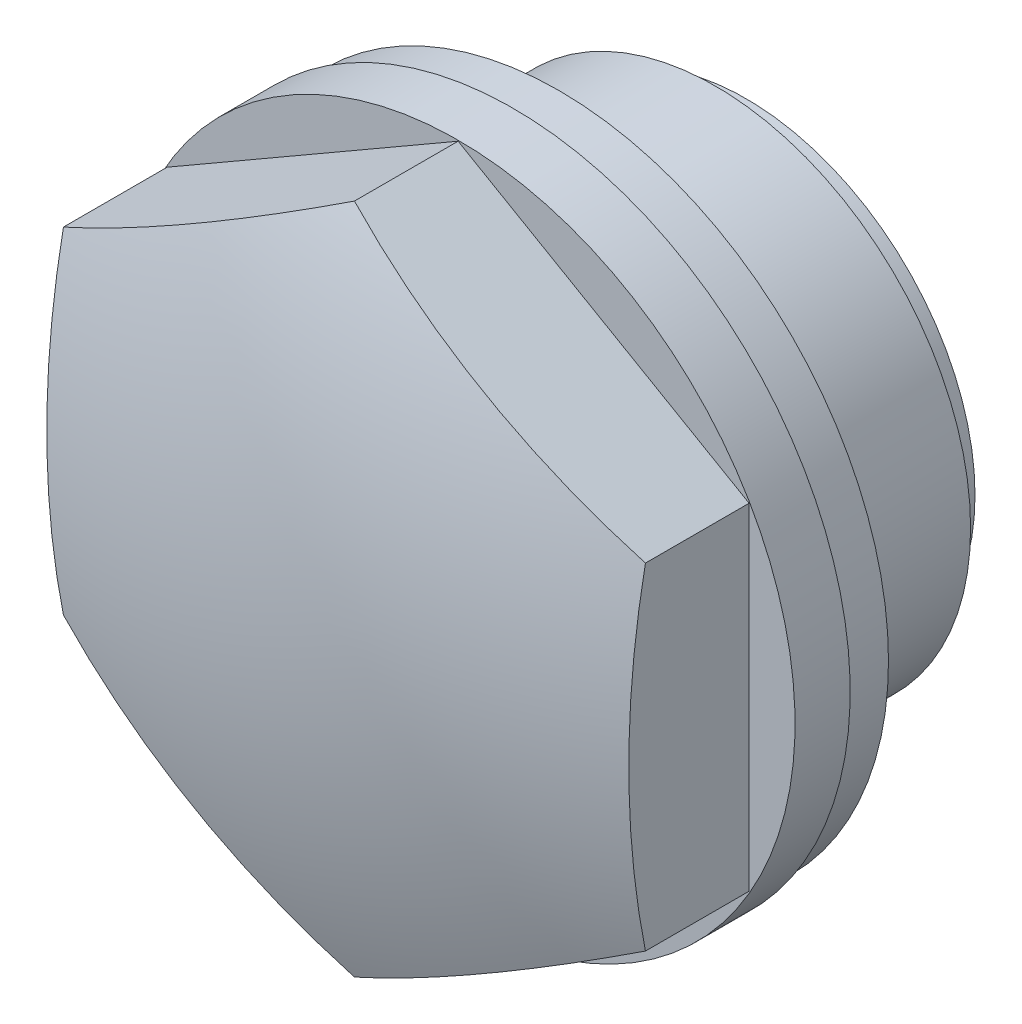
ISO-10303-21;
HEADER;
FILE_DESCRIPTION(('STEP AP214'),'2;1');
FILE_NAME('part.step','',(''),(''),'','','');
FILE_SCHEMA(('AUTOMOTIVE_DESIGN { 1 0 10303 214 1 1 1 1 }'));
ENDSEC;
DATA;
#1=APPLICATION_CONTEXT('core data for automotive mechanical design processes');
#2=APPLICATION_PROTOCOL_DEFINITION('international standard','automotive_design',2000,#1);
#3=PRODUCT_CONTEXT('',#1,'mechanical');
#4=PRODUCT('Part','Part','',(#3));
#5=PRODUCT_RELATED_PRODUCT_CATEGORY('part','',(#4));
#6=PRODUCT_DEFINITION_FORMATION('','',#4);
#7=PRODUCT_DEFINITION_CONTEXT('part definition',#1,'design');
#8=PRODUCT_DEFINITION('design','',#6,#7);
#9=PRODUCT_DEFINITION_SHAPE('','',#8);
#10=(LENGTH_UNIT() NAMED_UNIT(*) SI_UNIT(.MILLI.,.METRE.));
#11=(NAMED_UNIT(*) PLANE_ANGLE_UNIT() SI_UNIT($,.RADIAN.));
#12=(NAMED_UNIT(*) SI_UNIT($,.STERADIAN.) SOLID_ANGLE_UNIT());
#13=UNCERTAINTY_MEASURE_WITH_UNIT(LENGTH_MEASURE(1.E-05),#10,'distance_accuracy_value','');
#14=(GEOMETRIC_REPRESENTATION_CONTEXT(3) GLOBAL_UNCERTAINTY_ASSIGNED_CONTEXT((#13)) GLOBAL_UNIT_ASSIGNED_CONTEXT((#10,
#11,#12)) REPRESENTATION_CONTEXT('',''));
#15=CARTESIAN_POINT('',(0.,0.,0.));
#16=DIRECTION('',(0.,0.,1.));
#17=DIRECTION('',(1.,0.,0.));
#18=AXIS2_PLACEMENT_3D('',#15,#16,#17);
#19=CARTESIAN_POINT('',(0.,0.,-6.0999999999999));
#20=DIRECTION('',(0.,0.,-1.));
#21=DIRECTION('',(-1.,0.,0.));
#22=AXIS2_PLACEMENT_3D('',#19,#20,#21);
#23=PLANE('',#22);
#24=CARTESIAN_POINT('',(0.,0.,-6.0999999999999));
#25=DIRECTION('',(0.,0.,-1.));
#26=DIRECTION('',(-1.,0.,0.));
#27=AXIS2_PLACEMENT_3D('',#24,#25,#26);
#28=CIRCLE('',#27,7.475);
#29=CARTESIAN_POINT('',(-7.475,0.,-6.0999999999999));
#30=VERTEX_POINT('',#29);
#31=EDGE_CURVE('E124',#30,#30,#28,.T.);
#32=ORIENTED_EDGE('',*,*,#31,.T.);
#33=EDGE_LOOP('',(#32));
#34=FACE_BOUND('',#33,.T.);
#35=ADVANCED_FACE('F14',(#34),#23,.T.);
#36=CARTESIAN_POINT('',(0.,0.,-4.3000699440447));
#37=DIRECTION('',(0.,0.,-1.));
#38=DIRECTION('',(-1.,0.,0.));
#39=AXIS2_PLACEMENT_3D('',#36,#37,#38);
#40=CYLINDRICAL_SURFACE('',#39,7.475);
#41=ORIENTED_EDGE('',*,*,#31,.F.);
#42=EDGE_LOOP('',(#41));
#43=FACE_BOUND('',#42,.T.);
#44=CARTESIAN_POINT('',(0.,0.,-5.0999999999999));
#45=DIRECTION('',(0.,0.,-1.));
#46=DIRECTION('',(-1.,0.,0.));
#47=AXIS2_PLACEMENT_3D('',#44,#45,#46);
#48=CIRCLE('',#47,7.475);
#49=CARTESIAN_POINT('',(-7.475,0.,-5.0999999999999));
#50=VERTEX_POINT('',#49);
#51=EDGE_CURVE('E121',#50,#50,#48,.T.);
#52=ORIENTED_EDGE('',*,*,#51,.T.);
#53=EDGE_LOOP('',(#52));
#54=FACE_BOUND('',#53,.T.);
#55=ADVANCED_FACE('F161',(#43,#54),#40,.T.);
#56=CARTESIAN_POINT('',(0.,7.475,-5.0999999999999));
#57=DIRECTION('',(0.,0.,-1.));
#58=DIRECTION('',(-1.,0.,0.));
#59=AXIS2_PLACEMENT_3D('',#56,#57,#58);
#60=PLANE('',#59);
#61=CARTESIAN_POINT('',(0.,0.,-5.0999999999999));
#62=DIRECTION('',(0.,0.,-1.));
#63=DIRECTION('',(-1.,0.,0.));
#64=AXIS2_PLACEMENT_3D('',#61,#62,#63);
#65=CIRCLE('',#64,8.331);
#66=CARTESIAN_POINT('',(-8.331,0.,-5.0999999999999));
#67=VERTEX_POINT('',#66);
#68=EDGE_CURVE('E118',#67,#67,#65,.T.);
#69=ORIENTED_EDGE('',*,*,#68,.T.);
#70=EDGE_LOOP('',(#69));
#71=FACE_BOUND('',#70,.T.);
#72=ORIENTED_EDGE('',*,*,#51,.F.);
#73=EDGE_LOOP('',(#72));
#74=FACE_BOUND('',#73,.T.);
#75=ADVANCED_FACE('F167',(#71,#74),#60,.T.);
#76=CARTESIAN_POINT('',(0.,0.,-4.3000699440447));
#77=DIRECTION('',(0.,0.,-1.));
#78=DIRECTION('',(-1.,0.,0.));
#79=AXIS2_PLACEMENT_3D('',#76,#77,#78);
#80=CYLINDRICAL_SURFACE('',#79,8.331);
#81=ORIENTED_EDGE('',*,*,#68,.F.);
#82=EDGE_LOOP('',(#81));
#83=FACE_BOUND('',#82,.T.);
#84=CARTESIAN_POINT('',(0.,0.,0.));
#85=DIRECTION('',(0.,0.,-1.));
#86=DIRECTION('',(-1.,0.,0.));
#87=AXIS2_PLACEMENT_3D('',#84,#85,#86);
#88=CIRCLE('',#87,8.331);
#89=CARTESIAN_POINT('',(-8.331,0.,0.));
#90=VERTEX_POINT('',#89);
#91=EDGE_CURVE('E115',#90,#90,#88,.T.);
#92=ORIENTED_EDGE('',*,*,#91,.T.);
#93=EDGE_LOOP('',(#92));
#94=FACE_BOUND('',#93,.T.);
#95=ADVANCED_FACE('F174',(#83,#94),#80,.T.);
#96=CARTESIAN_POINT('',(0.,10.75,0.));
#97=DIRECTION('',(0.,0.,1.));
#98=DIRECTION('',(1.,0.,0.));
#99=AXIS2_PLACEMENT_3D('',#96,#97,#98);
#100=PLANE('',#99);
#101=ORIENTED_EDGE('',*,*,#91,.F.);
#102=EDGE_LOOP('',(#101));
#103=FACE_BOUND('',#102,.T.);
#104=CARTESIAN_POINT('',(0.,0.,0.));
#105=DIRECTION('',(0.,0.,-1.));
#106=DIRECTION('',(-1.,0.,0.));
#107=AXIS2_PLACEMENT_3D('',#104,#105,#106);
#108=CIRCLE('',#107,10.75);
#109=CARTESIAN_POINT('',(-10.75,0.,0.));
#110=VERTEX_POINT('',#109);
#111=EDGE_CURVE('E112',#110,#110,#108,.T.);
#112=ORIENTED_EDGE('',*,*,#111,.T.);
#113=EDGE_LOOP('',(#112));
#114=FACE_BOUND('',#113,.T.);
#115=ADVANCED_FACE('F181',(#103,#114),#100,.F.);
#116=CARTESIAN_POINT('',(0.,0.,-4.3000699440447));
#117=DIRECTION('',(0.,0.,-1.));
#118=DIRECTION('',(-1.,0.,0.));
#119=AXIS2_PLACEMENT_3D('',#116,#117,#118);
#120=CYLINDRICAL_SURFACE('',#119,10.75);
#121=CARTESIAN_POINT('',(0.,0.,1.5));
#122=DIRECTION('',(0.,0.,-1.));
#123=DIRECTION('',(-1.,0.,0.));
#124=AXIS2_PLACEMENT_3D('',#121,#122,#123);
#125=CIRCLE('',#124,10.75);
#126=CARTESIAN_POINT('',(-10.75,0.,1.5));
#127=VERTEX_POINT('',#126);
#128=EDGE_CURVE('E109',#127,#127,#125,.T.);
#129=ORIENTED_EDGE('',*,*,#128,.T.);
#130=EDGE_LOOP('',(#129));
#131=FACE_BOUND('',#130,.T.);
#132=ORIENTED_EDGE('',*,*,#111,.F.);
#133=EDGE_LOOP('',(#132));
#134=FACE_BOUND('',#133,.T.);
#135=ADVANCED_FACE('F187',(#131,#134),#120,.T.);
#136=CARTESIAN_POINT('',(0.,10.75,1.5));
#137=DIRECTION('',(0.,0.,-1.));
#138=DIRECTION('',(-1.,0.,0.));
#139=AXIS2_PLACEMENT_3D('',#136,#137,#138);
#140=PLANE('',#139);
#141=CARTESIAN_POINT('',(0.,0.,1.5000000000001));
#142=DIRECTION('',(0.,0.,-1.));
#143=DIRECTION('',(-1.,0.,0.));
#144=AXIS2_PLACEMENT_3D('',#141,#142,#143);
#145=CIRCLE('',#144,11.);
#146=CARTESIAN_POINT('',(-11.,0.,1.5000000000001));
#147=VERTEX_POINT('',#146);
#148=EDGE_CURVE('E106',#147,#147,#145,.T.);
#149=ORIENTED_EDGE('',*,*,#148,.T.);
#150=EDGE_LOOP('',(#149));
#151=FACE_BOUND('',#150,.T.);
#152=ORIENTED_EDGE('',*,*,#128,.F.);
#153=EDGE_LOOP('',(#152));
#154=FACE_BOUND('',#153,.T.);
#155=ADVANCED_FACE('F191',(#151,#154),#140,.T.);
#156=CARTESIAN_POINT('',(0.,0.,-4.3000699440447));
#157=DIRECTION('',(0.,0.,-1.));
#158=DIRECTION('',(-1.,0.,0.));
#159=AXIS2_PLACEMENT_3D('',#156,#157,#158);
#160=CYLINDRICAL_SURFACE('',#159,11.);
#161=ORIENTED_EDGE('',*,*,#148,.F.);
#162=EDGE_LOOP('',(#161));
#163=FACE_BOUND('',#162,.T.);
#164=CARTESIAN_POINT('',(0.,0.,3.30000000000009));
#165=DIRECTION('',(0.,0.,-1.));
#166=DIRECTION('',(-1.,0.,0.));
#167=AXIS2_PLACEMENT_3D('',#164,#165,#166);
#168=CIRCLE('',#167,11.);
#169=CARTESIAN_POINT('',(-11.,0.,3.30000000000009));
#170=VERTEX_POINT('',#169);
#171=EDGE_CURVE('E103',#170,#170,#168,.T.);
#172=ORIENTED_EDGE('',*,*,#171,.T.);
#173=EDGE_LOOP('',(#172));
#174=FACE_BOUND('',#173,.T.);
#175=ADVANCED_FACE('F195',(#163,#174),#160,.T.);
#176=CARTESIAN_POINT('',(0.,10.9696551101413,3.30000000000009));
#177=DIRECTION('',(0.,0.,-1.));
#178=DIRECTION('',(-1.,0.,0.));
#179=AXIS2_PLACEMENT_3D('',#176,#177,#178);
#180=PLANE('',#179);
#181=ORIENTED_EDGE('',*,*,#171,.F.);
#182=EDGE_LOOP('',(#181));
#183=FACE_BOUND('',#182,.T.);
#184=DIRECTION('',(0.,1.,0.));
#185=VECTOR('',#184,1.);
#186=CARTESIAN_POINT('',(-9.49999999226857,-5.4848275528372,3.30000000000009));
#187=LINE('',#186,#185);
#188=CARTESIAN_POINT('',(-9.49999999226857,-5.4848275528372,3.30000000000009));
#189=VERTEX_POINT('',#188);
#190=CARTESIAN_POINT('',(-9.49999999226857,5.4848275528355,3.30000000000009));
#191=VERTEX_POINT('',#190);
#192=EDGE_CURVE('E93',#189,#191,#187,.T.);
#193=ORIENTED_EDGE('',*,*,#192,.T.);
#194=DIRECTION('',(0.866025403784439,0.5,0.));
#195=VECTOR('',#194,1.);
#196=CARTESIAN_POINT('',(-9.49999999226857,5.4848275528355,3.30000000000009));
#197=LINE('',#196,#195);
#198=CARTESIAN_POINT('',(-3.86409654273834E-12,10.969655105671,3.30000000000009));
#199=VERTEX_POINT('',#198);
#200=EDGE_CURVE('E83',#191,#199,#197,.T.);
#201=ORIENTED_EDGE('',*,*,#200,.T.);
#202=DIRECTION('',(0.866025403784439,-0.5,0.));
#203=VECTOR('',#202,1.);
#204=CARTESIAN_POINT('',(-3.86496390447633E-12,10.969655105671,3.30000000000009));
#205=LINE('',#204,#203);
#206=CARTESIAN_POINT('',(9.49999999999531,5.48482754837,3.30000000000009));
#207=VERTEX_POINT('',#206);
#208=EDGE_CURVE('E68',#199,#207,#205,.T.);
#209=ORIENTED_EDGE('',*,*,#208,.T.);
#210=DIRECTION('',(-7.05456573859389E-10,-1.,0.));
#211=VECTOR('',#210,1.);
#212=CARTESIAN_POINT('',(9.49999999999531,5.48482754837,3.30000000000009));
#213=LINE('',#212,#211);
#214=CARTESIAN_POINT('',(9.49999999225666,-5.48482756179,3.30000000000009));
#215=VERTEX_POINT('',#214);
#216=EDGE_CURVE('E80',#207,#215,#213,.T.);
#217=ORIENTED_EDGE('',*,*,#216,.T.);
#218=DIRECTION('',(-0.866025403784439,-0.5,0.));
#219=VECTOR('',#218,1.);
#220=CARTESIAN_POINT('',(9.4999999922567,-5.4848275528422,3.30000000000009));
#221=LINE('',#220,#219);
#222=CARTESIAN_POINT('',(-1.52655665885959E-12,-10.969655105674,3.30000000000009));
#223=VERTEX_POINT('',#222);
#224=EDGE_CURVE('E28',#215,#223,#221,.T.);
#225=ORIENTED_EDGE('',*,*,#224,.T.);
#226=DIRECTION('',(-0.866025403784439,0.5,0.));
#227=VECTOR('',#226,1.);
#228=CARTESIAN_POINT('',(-1.52655665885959E-12,-10.969655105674,3.30000000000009));
#229=LINE('',#228,#227);
#230=EDGE_CURVE('E87',#223,#189,#229,.T.);
#231=ORIENTED_EDGE('',*,*,#230,.T.);
#232=EDGE_LOOP('',(#193,#201,#209,#217,#225,#231));
#233=FACE_BOUND('',#232,.T.);
#234=ADVANCED_FACE('F79',(#183,#233),#180,.F.);
#235=CARTESIAN_POINT('',(-9.49999999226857,5.4848275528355,8.8000000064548));
#236=DIRECTION('',(-0.5,0.866025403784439,0.));
#237=DIRECTION('',(0.866025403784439,0.5,0.));
#238=AXIS2_PLACEMENT_3D('',#235,#236,#237);
#239=PLANE('',#238);
#240=DIRECTION('',(0.,0.,-1.));
#241=VECTOR('',#240,1.);
#242=CARTESIAN_POINT('',(-3.86496390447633E-12,10.969655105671,8.8000000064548));
#243=LINE('',#242,#241);
#244=CARTESIAN_POINT('',(-7.74681568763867E-09,10.9696551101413,6.68460638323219));
#245=VERTEX_POINT('',#244);
#246=EDGE_CURVE('E36',#245,#199,#243,.T.);
#247=ORIENTED_EDGE('',*,*,#246,.T.);
#248=ORIENTED_EDGE('',*,*,#200,.F.);
#249=DIRECTION('',(0.,0.,-1.));
#250=VECTOR('',#249,1.);
#251=CARTESIAN_POINT('',(-9.49999999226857,5.4848275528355,8.8000000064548));
#252=LINE('',#251,#250);
#253=CARTESIAN_POINT('',(-9.49999999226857,5.4848275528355,6.6846063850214));
#254=VERTEX_POINT('',#253);
#255=EDGE_CURVE('E101',#254,#191,#252,.T.);
#256=ORIENTED_EDGE('',*,*,#255,.F.);
#257=CARTESIAN_POINT('',(-4.74999999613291,8.22724132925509,-20.6999999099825));
#258=DIRECTION('',(-0.5,0.866025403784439,0.));
#259=DIRECTION('',(0.866025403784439,0.5,0.));
#260=AXIS2_PLACEMENT_3D('',#257,#258,#259);
#261=CIRCLE('',#260,27.9284800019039);
#262=EDGE_CURVE('E9',#245,#254,#261,.F.);
#263=ORIENTED_EDGE('',*,*,#262,.F.);
#264=EDGE_LOOP('',(#247,#248,#256,#263));
#265=FACE_BOUND('',#264,.T.);
#266=ADVANCED_FACE('F144',(#265),#239,.T.);
#267=CARTESIAN_POINT('',(-9.49999999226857,-5.4848275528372,8.8000000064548));
#268=DIRECTION('',(-1.,0.,0.));
#269=DIRECTION('',(0.,0.,1.));
#270=AXIS2_PLACEMENT_3D('',#267,#268,#269);
#271=PLANE('',#270);
#272=ORIENTED_EDGE('',*,*,#255,.T.);
#273=ORIENTED_EDGE('',*,*,#192,.F.);
#274=DIRECTION('',(0.,0.,-1.));
#275=VECTOR('',#274,1.);
#276=CARTESIAN_POINT('',(-9.49999999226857,-5.4848275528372,8.8000000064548));
#277=LINE('',#276,#275);
#278=CARTESIAN_POINT('',(-9.49999999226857,-5.4848275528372,6.68460638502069));
#279=VERTEX_POINT('',#278);
#280=EDGE_CURVE('E99',#279,#189,#277,.T.);
#281=ORIENTED_EDGE('',*,*,#280,.F.);
#282=CARTESIAN_POINT('',(-9.49999999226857,9.0205620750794E-13,-20.6999999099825));
#283=DIRECTION('',(-1.,0.,0.));
#284=DIRECTION('',(0.,0.,1.));
#285=AXIS2_PLACEMENT_3D('',#282,#283,#284);
#286=CIRCLE('',#285,27.928480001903);
#287=EDGE_CURVE('E21',#254,#279,#286,.F.);
#288=ORIENTED_EDGE('',*,*,#287,.F.);
#289=EDGE_LOOP('',(#272,#273,#281,#288));
#290=FACE_BOUND('',#289,.T.);
#291=ADVANCED_FACE('F141',(#290),#271,.T.);
#292=CARTESIAN_POINT('',(-1.52655665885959E-12,-10.969655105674,8.8000000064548));
#293=DIRECTION('',(-0.5,-0.866025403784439,0.));
#294=DIRECTION('',(-0.866025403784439,0.5,0.));
#295=AXIS2_PLACEMENT_3D('',#292,#293,#294);
#296=PLANE('',#295);
#297=ORIENTED_EDGE('',*,*,#280,.T.);
#298=ORIENTED_EDGE('',*,*,#230,.F.);
#299=DIRECTION('',(0.,0.,-1.));
#300=VECTOR('',#299,1.);
#301=CARTESIAN_POINT('',(-1.52655665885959E-12,-10.969655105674,8.8000000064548));
#302=LINE('',#301,#300);
#303=CARTESIAN_POINT('',(-1.52482193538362E-12,-10.969655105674,6.6846063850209));
#304=VERTEX_POINT('',#303);
#305=EDGE_CURVE('E97',#304,#223,#302,.T.);
#306=ORIENTED_EDGE('',*,*,#305,.F.);
#307=CARTESIAN_POINT('',(-4.74999999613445,-8.22724132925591,-20.6999999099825));
#308=DIRECTION('',(-0.5,-0.866025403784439,0.));
#309=DIRECTION('',(-0.866025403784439,0.5,0.));
#310=AXIS2_PLACEMENT_3D('',#307,#308,#309);
#311=CIRCLE('',#310,27.9284800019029);
#312=EDGE_CURVE('E133',#279,#304,#311,.F.);
#313=ORIENTED_EDGE('',*,*,#312,.F.);
#314=EDGE_LOOP('',(#297,#298,#306,#313));
#315=FACE_BOUND('',#314,.T.);
#316=ADVANCED_FACE('F149',(#315),#296,.T.);
#317=CARTESIAN_POINT('',(9.4999999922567,-5.4848275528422,8.8000000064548));
#318=DIRECTION('',(0.5,-0.866025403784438,0.));
#319=DIRECTION('',(-0.866025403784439,-0.5,0.));
#320=AXIS2_PLACEMENT_3D('',#317,#318,#319);
#321=PLANE('',#320);
#322=ORIENTED_EDGE('',*,*,#305,.T.);
#323=ORIENTED_EDGE('',*,*,#224,.F.);
#324=DIRECTION('',(0.,0.,-1.));
#325=VECTOR('',#324,1.);
#326=CARTESIAN_POINT('',(9.4999999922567,-5.4848275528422,8.8000000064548));
#327=LINE('',#326,#325);
#328=CARTESIAN_POINT('',(9.49999999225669,-5.4848275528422,6.6846063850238));
#329=VERTEX_POINT('',#328);
#330=EDGE_CURVE('E74',#329,#215,#327,.T.);
#331=ORIENTED_EDGE('',*,*,#330,.F.);
#332=CARTESIAN_POINT('',(4.74999999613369,-8.22724132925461,-20.6999999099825));
#333=DIRECTION('',(0.5,-0.866025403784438,0.));
#334=DIRECTION('',(-0.866025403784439,-0.5,0.));
#335=AXIS2_PLACEMENT_3D('',#332,#333,#334);
#336=CIRCLE('',#335,27.9284800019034);
#337=EDGE_CURVE('E130',#304,#329,#336,.F.);
#338=ORIENTED_EDGE('',*,*,#337,.F.);
#339=EDGE_LOOP('',(#322,#323,#331,#338));
#340=FACE_BOUND('',#339,.T.);
#341=ADVANCED_FACE('F145',(#340),#321,.T.);
#342=CARTESIAN_POINT('',(9.49999999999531,5.48482754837,8.8000000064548));
#343=DIRECTION('',(1.,-7.05456573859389E-10,0.));
#344=DIRECTION('',(-7.05456573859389E-10,-1.,0.));
#345=AXIS2_PLACEMENT_3D('',#342,#343,#344);
#346=PLANE('',#345);
#347=ORIENTED_EDGE('',*,*,#330,.T.);
#348=ORIENTED_EDGE('',*,*,#216,.F.);
#349=DIRECTION('',(0.,0.,-1.));
#350=VECTOR('',#349,1.);
#351=CARTESIAN_POINT('',(9.49999999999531,5.48482754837,8.8000000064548));
#352=LINE('',#351,#350);
#353=CARTESIAN_POINT('',(9.49999999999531,5.48482754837,6.6846063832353));
#354=VERTEX_POINT('',#353);
#355=EDGE_CURVE('E65',#354,#207,#352,.T.);
#356=ORIENTED_EDGE('',*,*,#355,.F.);
#357=CARTESIAN_POINT('',(9.499999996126,-6.70090372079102E-09,-20.6999999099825));
#358=DIRECTION('',(1.,-7.05456573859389E-10,0.));
#359=DIRECTION('',(-7.05456573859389E-10,-1.,0.));
#360=AXIS2_PLACEMENT_3D('',#357,#358,#359);
#361=CIRCLE('',#360,27.9284800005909);
#362=EDGE_CURVE('E128',#329,#354,#361,.F.);
#363=ORIENTED_EDGE('',*,*,#362,.F.);
#364=EDGE_LOOP('',(#347,#348,#356,#363));
#365=FACE_BOUND('',#364,.T.);
#366=ADVANCED_FACE('F85',(#365),#346,.T.);
#367=CARTESIAN_POINT('',(-3.86496390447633E-12,10.969655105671,8.8000000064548));
#368=DIRECTION('',(0.5,0.866025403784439,0.));
#369=DIRECTION('',(0.866025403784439,-0.5,0.));
#370=AXIS2_PLACEMENT_3D('',#367,#368,#369);
#371=PLANE('',#370);
#372=ORIENTED_EDGE('',*,*,#355,.T.);
#373=ORIENTED_EDGE('',*,*,#208,.F.);
#374=ORIENTED_EDGE('',*,*,#246,.F.);
#375=CARTESIAN_POINT('',(4.74999999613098,8.22724132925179,-20.6999999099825));
#376=DIRECTION('',(0.5,0.866025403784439,0.));
#377=DIRECTION('',(0.866025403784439,-0.5,0.));
#378=AXIS2_PLACEMENT_3D('',#375,#376,#377);
#379=CIRCLE('',#378,27.9284800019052);
#380=EDGE_CURVE('E70',#354,#245,#379,.F.);
#381=ORIENTED_EDGE('',*,*,#380,.F.);
#382=EDGE_LOOP('',(#372,#373,#374,#381));
#383=FACE_BOUND('',#382,.T.);
#384=ADVANCED_FACE('F67',(#383),#371,.T.);
#385=CARTESIAN_POINT('',(0.,9.0205620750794E-13,-20.6999999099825));
#386=DIRECTION('',(1.,0.,0.));
#387=DIRECTION('',(0.,0.,-1.));
#388=AXIS2_PLACEMENT_3D('',#385,#386,#387);
#389=SPHERICAL_SURFACE('',#388,29.4999999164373);
#390=ORIENTED_EDGE('',*,*,#380,.T.);
#391=ORIENTED_EDGE('',*,*,#262,.T.);
#392=ORIENTED_EDGE('',*,*,#287,.T.);
#393=ORIENTED_EDGE('',*,*,#312,.T.);
#394=ORIENTED_EDGE('',*,*,#337,.T.);
#395=ORIENTED_EDGE('',*,*,#362,.T.);
#396=EDGE_LOOP('',(#390,#391,#392,#393,#394,#395));
#397=FACE_BOUND('',#396,.T.);
#398=ADVANCED_FACE('F137',(#397),#389,.T.);
#399=CLOSED_SHELL('',(#35,#55,#75,#95,#115,#135,#155,#175,#234,#266,#291,#316,#341,#366,#384,#398));
#400=MANIFOLD_SOLID_BREP('B1',#399);
#401=ADVANCED_BREP_SHAPE_REPRESENTATION('',(#18,#400),#14);
#402=SHAPE_DEFINITION_REPRESENTATION(#9,#401);
ENDSEC;
END-ISO-10303-21;
